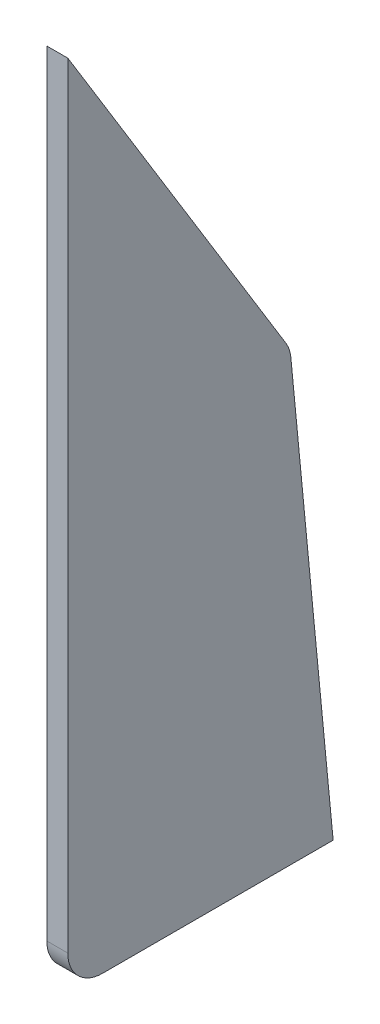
from build123d import *

# Parameters (mm, degrees)
EXTRUSION1_DEPTH = 3


with BuildPart() as part:
    # Esquisse1 → Extrusion1 (new body)
    with BuildSketch(Plane(origin=(0, 0, 0), x_dir=(0, 0, -1), z_dir=(1, 0, 0))):
        with BuildLine():
            Line((0, 0), (31.229113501, -50.961281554))
            ThreePointArc((31.229113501, -50.961281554), (31.707530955, -51.987251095), (31.942893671, -53.094545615))
            Line((31.942893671, -53.094545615), (38, -116))
            Line((38, -116), (5, -116))
            ThreePointArc((5, -116), (1.464466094, -114.535533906), (0, -111))
            Line((0, -111), (0, 0))
        make_face()
    extrude(amount=EXTRUSION1_DEPTH)


solid = part.part
